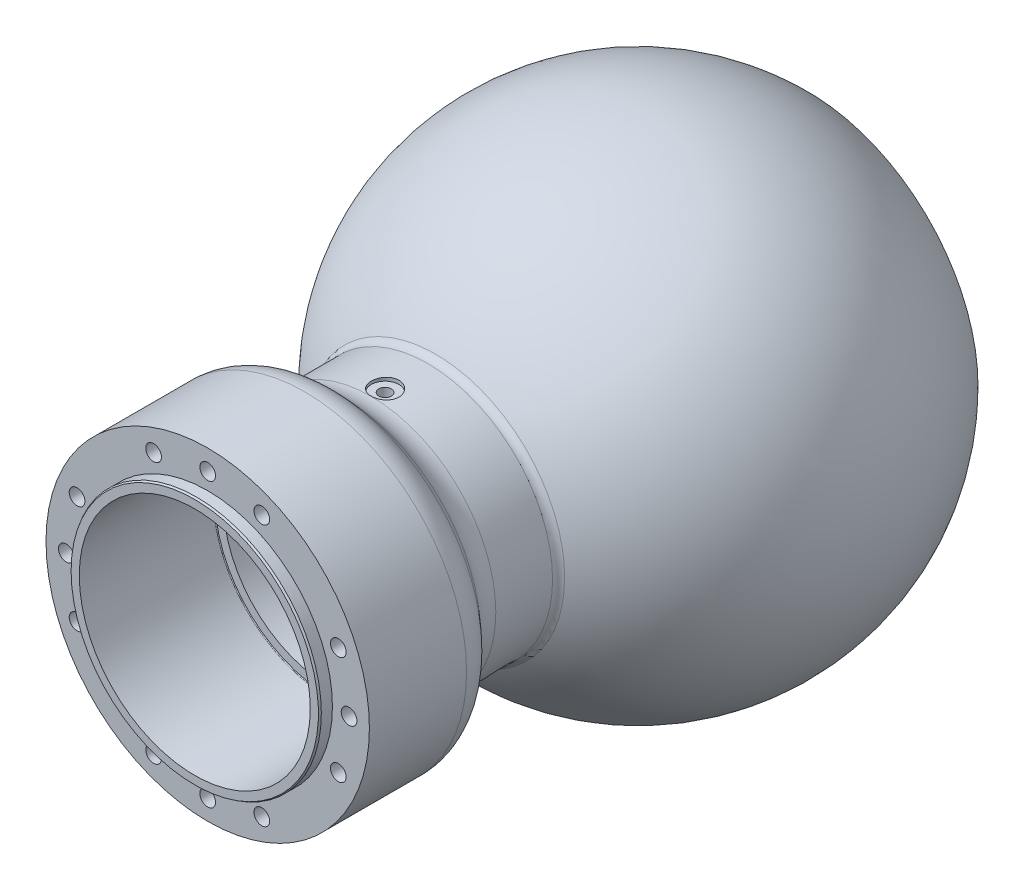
from build123d import *

# Parameters (mm, degrees)
CONG_1_R                     = 5
R_P_TITION_CIRCULAIRE1_COUNT = 3
R_P_TITION_CIRCULAIRE1_ANGLE = 45
R_P_TITION_CIRCULAIRE2_COUNT = 4
ESQUISSE8_R                  = 7.5
EXTRUSION3_DEPTH             = 2
TROU_TARAUD_M81_D            = 6.8
TROU_TARAUD_M81_DEPTH        = 30
TROU_TARAUD_M81_TIP          = 2.042926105
ESQUISSE11_R                 = 7.5
EXTRUSION4_DEPTH             = 2
R_P_TITION_CIRCULAIRE3_COUNT = 2
R_P_TITION_CIRCULAIRE3_ANGLE = 90
CHANFREIN1_SIZE              = 1
CHANFREIN1_SIZE2             = 0.577350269


with BuildPart() as part:
    # Esquisse1 → R_volution1 (revolve)
    with BuildSketch(Plane(origin=(0, 0, 0), x_dir=(0, 0, -1), z_dir=(1, 0, 0)), mode=Mode.PRIVATE) as r_volution1_sk:
        with BuildLine():
            Line((0, 62.5), (72.6, 62.5))
            ThreePointArc((72.6, 62.5), (72.882842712, 62.382842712), (73, 62.1))
            Line((73, 62.1), (73, 57.5))
            Line((73, 57.5), (134.675311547, 57.5))
            ThreePointArc((134.675311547, 57.5), (219.203368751, 118.180178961), (319.368003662, 90))
            Line((319.368003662, 90), (332, 90))
            Line((332, 90), (332, 91.843700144))
            ThreePointArc((332, 91.843700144), (224.528851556, 129.072115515), (128.9, 67.5))
            Line((128.9, 67.5), (95.407248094, 67.5))
            ThreePointArc((95.407248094, 67.5), (87.270476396, 69.229998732), (80.541365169, 74.120705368))
            Line((80.541365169, 74.120705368), (74.458634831, 80.879294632))
            ThreePointArc((74.458634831, 80.879294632), (67.729523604, 85.770001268), (59.592751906, 87.5))
            Line((59.592751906, 87.5), (7, 87.5))
            Line((7, 87.5), (7, 67.5))
            Line((7, 67.5), (0, 67.5))
            Line((0, 67.5), (0, 62.5))
        make_face()
    revolve(r_volution1_sk.sketch.rotate(Axis((0, 0, 0), (0, 0, -1)), 90), axis=Axis((0, 0, 0), (0, 0, -1)))

    # Cong_1
    cong_1_edges = [part.edges().sort_by_distance(p)[0] for p in [
        (-67.5, 0, -128.9),
        (-57.5, 0, -134.675311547),
    ]]
    fillet(cong_1_edges, radius=CONG_1_R)

    # Esquisse3 → Trou taraud_ M101 (revolve, cut)
    with BuildSketch(Plane(origin=(-29.275282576, 70.676784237, -7), x_dir=(0, -1, 0), z_dir=(1, 0, 0))):
        Polygon((0, 0), (0, 27.553657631), (4.25, 25), (4.25, 0), align=None)
    trou_taraud_m101 = revolve(axis=Axis((-29.275282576, 70.676784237, -0.65), (0, 0, -1)), mode=Mode.SUBTRACT)

    # R_p_tition circulaire1: Trou taraud_ M101 ×3 about axis
    r_p_tition_circulaire1_axis = Axis((0, 0, 0), (0, 0, -1))
    for i in range(1, R_P_TITION_CIRCULAIRE1_COUNT):
        add(trou_taraud_m101.rotate(r_p_tition_circulaire1_axis, i * R_P_TITION_CIRCULAIRE1_ANGLE / (R_P_TITION_CIRCULAIRE1_COUNT - 1)), mode=Mode.SUBTRACT)

    # R_p_tition circulaire2: Trou taraud_ M101 ×4 about axis
    r_p_tition_circulaire2_axis = Axis((0, 0, 0), (0, 0, 1))
    for i in range(1, R_P_TITION_CIRCULAIRE2_COUNT):
        add(trou_taraud_m101.rotate(r_p_tition_circulaire2_axis, i * 360 / R_P_TITION_CIRCULAIRE2_COUNT), mode=Mode.SUBTRACT)

    # R_p_tition circulaire2 copy 1 sketch → R_p_tition circulaire2 copy 1 (revolve, cut)
    with BuildSketch(Plane(origin=(-76.5, 0, -7), x_dir=(0.9238795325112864, -0.3826834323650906, 0), z_dir=(0.3826834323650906, 0.9238795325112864, 0))):
        Polygon((0, 0), (0, 27.553657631), (4.25, 25), (4.25, 0), align=None)
    revolve(axis=Axis((-76.5, 0, -0.65), (0, 0, -1)), mode=Mode.SUBTRACT)

    # R_p_tition circulaire2 copy 2 sketch → R_p_tition circulaire2 copy 2 (revolve, cut)
    with BuildSketch(Plane(origin=(0, -76.5, -7), x_dir=(0.38268343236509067, 0.9238795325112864, 0), z_dir=(-0.9238795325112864, 0.38268343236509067, 0))):
        Polygon((0, 0), (0, 27.553657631), (4.25, 25), (4.25, 0), align=None)
    revolve(axis=Axis((0, -76.5, -0.65), (0, 0, -1)), mode=Mode.SUBTRACT)

    # R_p_tition circulaire2 copy 3 sketch → R_p_tition circulaire2 copy 3 (revolve, cut)
    with BuildSketch(Plane(origin=(76.5, 0, -7), x_dir=(-0.9238795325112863, 0.3826834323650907, 0), z_dir=(-0.3826834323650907, -0.9238795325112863, 0))):
        Polygon((0, 0), (0, 27.553657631), (4.25, 25), (4.25, 0), align=None)
    revolve(axis=Axis((76.5, 0, -0.65), (0, 0, -1)), mode=Mode.SUBTRACT)

    # R_p_tition circulaire2 copy 4 sketch → R_p_tition circulaire2 copy 4 (revolve, cut)
    with BuildSketch(Plane(origin=(-70.676784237, 29.275282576, -7), x_dir=(0.7071067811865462, -0.7071067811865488, 0), z_dir=(0.7071067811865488, 0.7071067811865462, 0))):
        Polygon((0, 0), (0, 27.553657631), (4.25, 25), (4.25, 0), align=None)
    revolve(axis=Axis((-70.676784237, 29.275282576, -0.65), (0, 0, -1)), mode=Mode.SUBTRACT)

    # R_p_tition circulaire2 copy 5 sketch → R_p_tition circulaire2 copy 5 (revolve, cut)
    with BuildSketch(Plane(origin=(-29.275282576, -70.676784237, -7), x_dir=(0.7071067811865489, 0.7071067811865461, 0), z_dir=(-0.7071067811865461, 0.7071067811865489, 0))):
        Polygon((0, 0), (0, 27.553657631), (4.25, 25), (4.25, 0), align=None)
    revolve(axis=Axis((-29.275282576, -70.676784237, -0.65), (0, 0, -1)), mode=Mode.SUBTRACT)

    # R_p_tition circulaire2 copy 6 sketch → R_p_tition circulaire2 copy 6 (revolve, cut)
    with BuildSketch(Plane(origin=(70.676784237, -29.275282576, -7), x_dir=(-0.7071067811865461, 0.7071067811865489, 0), z_dir=(-0.7071067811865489, -0.7071067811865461, 0))):
        Polygon((0, 0), (0, 27.553657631), (4.25, 25), (4.25, 0), align=None)
    revolve(axis=Axis((70.676784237, -29.275282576, -0.65), (0, 0, -1)), mode=Mode.SUBTRACT)

    # Esquisse8 → Extrusion3 (cut)
    with BuildSketch(Plane(origin=(0, 67.5, 0), x_dir=(-1, 0, 0), z_dir=(0, 1, 0))):
        with Locations(Location((0, -103, 0), (0, 0, 90))):
            Circle(ESQUISSE8_R)
    extrude(amount=-EXTRUSION3_DEPTH, mode=Mode.SUBTRACT)

    # Trou taraud_ M81
    with Locations(Plane(origin=(0, 65.5, -103), x_dir=(0, 0, 1), z_dir=(0, 1, 0))):
        with Locations((0, 0)):
            Hole(TROU_TARAUD_M81_D / 2, depth=TROU_TARAUD_M81_DEPTH)
            with Locations((0, 0, -(TROU_TARAUD_M81_DEPTH + TROU_TARAUD_M81_TIP / 2))):  # 118° drill point
                Cone(0, TROU_TARAUD_M81_D / 2, TROU_TARAUD_M81_TIP, mode=Mode.SUBTRACT)

    # Esquisse11 → Extrusion4 (cut)
    with BuildSketch(Plane(origin=(-47.72970773, -47.72970773, 0), x_dir=(0.7071067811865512, -0.7071067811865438, 0), z_dir=(-0.7071067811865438, -0.7071067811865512, 0))):
        with Locations((0, -116)):
            Circle(ESQUISSE11_R)
    extrusion4 = extrude(amount=-EXTRUSION4_DEPTH, mode=Mode.SUBTRACT)

    # Esquisse12 → Trou taraud_ M82 (revolve, cut)
    with BuildSketch(Plane(origin=(-46.315494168, -46.315494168, -116), x_dir=(0.7071067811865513, -0.7071067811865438, 0), z_dir=(0, 0, 1))):
        Polygon((0, 0), (0, 32.042926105), (3.4, 30), (3.4, 0), align=None)
    trou_taraud_m82 = revolve(axis=Axis((-50.805622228, -50.805622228, -116), (0.7071067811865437, 0.7071067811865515, 0)), mode=Mode.SUBTRACT)

    # R_p_tition circulaire3: Extrusion4, Trou taraud_ M82 ×2 about axis
    r_p_tition_circulaire3_axis = Axis((0, 0, 0), (0, 0, 1))
    add([extrusion4.rotate(r_p_tition_circulaire3_axis, i * R_P_TITION_CIRCULAIRE3_ANGLE / (R_P_TITION_CIRCULAIRE3_COUNT - 1)) for i in range(1, R_P_TITION_CIRCULAIRE3_COUNT)], mode=Mode.SUBTRACT)
    add([trou_taraud_m82.rotate(r_p_tition_circulaire3_axis, i * R_P_TITION_CIRCULAIRE3_ANGLE / (R_P_TITION_CIRCULAIRE3_COUNT - 1)) for i in range(1, R_P_TITION_CIRCULAIRE3_COUNT)], mode=Mode.SUBTRACT)

    # Chanfrein1
    chanfrein1_edges = [part.edges().sort_by_distance(p)[0] for p in [
        (-67.5, 0, 0),
    ]]
    chanfrein1_side = [part.faces().sort_by_distance(p)[0] for p in [
        (-67.5, 0, -3.5),
    ]]
    chamfer(chanfrein1_edges, length=CHANFREIN1_SIZE, length2=CHANFREIN1_SIZE2, reference=chanfrein1_side[0])


solid = part.part
